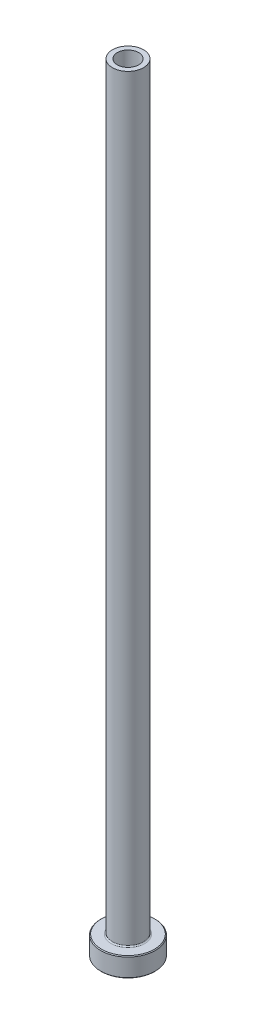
ISO-10303-21;
HEADER;
FILE_DESCRIPTION(('STEP AP214'),'2;1');
FILE_NAME('part.step','',(''),(''),'','','');
FILE_SCHEMA(('AUTOMOTIVE_DESIGN { 1 0 10303 214 1 1 1 1 }'));
ENDSEC;
DATA;
#1=APPLICATION_CONTEXT('core data for automotive mechanical design processes');
#2=APPLICATION_PROTOCOL_DEFINITION('international standard','automotive_design',2000,#1);
#3=PRODUCT_CONTEXT('',#1,'mechanical');
#4=PRODUCT('Part','Part','',(#3));
#5=PRODUCT_RELATED_PRODUCT_CATEGORY('part','',(#4));
#6=PRODUCT_DEFINITION_FORMATION('','',#4);
#7=PRODUCT_DEFINITION_CONTEXT('part definition',#1,'design');
#8=PRODUCT_DEFINITION('design','',#6,#7);
#9=PRODUCT_DEFINITION_SHAPE('','',#8);
#10=(LENGTH_UNIT() NAMED_UNIT(*) SI_UNIT(.MILLI.,.METRE.));
#11=(NAMED_UNIT(*) PLANE_ANGLE_UNIT() SI_UNIT($,.RADIAN.));
#12=(NAMED_UNIT(*) SI_UNIT($,.STERADIAN.) SOLID_ANGLE_UNIT());
#13=UNCERTAINTY_MEASURE_WITH_UNIT(LENGTH_MEASURE(1.E-05),#10,'distance_accuracy_value','');
#14=(GEOMETRIC_REPRESENTATION_CONTEXT(3) GLOBAL_UNCERTAINTY_ASSIGNED_CONTEXT((#13)) GLOBAL_UNIT_ASSIGNED_CONTEXT((#10,
#11,#12)) REPRESENTATION_CONTEXT('',''));
#15=CARTESIAN_POINT('',(0.,0.,0.));
#16=DIRECTION('',(0.,0.,1.));
#17=DIRECTION('',(1.,0.,0.));
#18=AXIS2_PLACEMENT_3D('',#15,#16,#17);
#19=CARTESIAN_POINT('',(0.,92.1876809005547,0.));
#20=DIRECTION('',(0.,1.,0.));
#21=DIRECTION('',(0.,0.,1.));
#22=AXIS2_PLACEMENT_3D('',#19,#20,#21);
#23=CYLINDRICAL_SURFACE('',#22,2.75);
#24=CARTESIAN_POINT('',(0.,200.,0.));
#25=DIRECTION('',(0.,1.,0.));
#26=DIRECTION('',(0.,0.,1.));
#27=AXIS2_PLACEMENT_3D('',#24,#25,#26);
#28=CIRCLE('',#27,2.75);
#29=CARTESIAN_POINT('',(0.,200.,2.75));
#30=VERTEX_POINT('',#29);
#31=EDGE_CURVE('E62',#30,#30,#28,.T.);
#32=ORIENTED_EDGE('',*,*,#31,.T.);
#33=EDGE_LOOP('',(#32));
#34=FACE_BOUND('',#33,.T.);
#35=CARTESIAN_POINT('',(0.,155.,0.));
#36=DIRECTION('',(0.,1.,0.));
#37=DIRECTION('',(0.,0.,1.));
#38=AXIS2_PLACEMENT_3D('',#35,#36,#37);
#39=CIRCLE('',#38,2.75);
#40=CARTESIAN_POINT('',(0.,155.,2.75));
#41=VERTEX_POINT('',#40);
#42=EDGE_CURVE('E71',#41,#41,#39,.T.);
#43=ORIENTED_EDGE('',*,*,#42,.F.);
#44=EDGE_LOOP('',(#43));
#45=FACE_BOUND('',#44,.T.);
#46=ADVANCED_FACE('F30',(#34,#45),#23,.F.);
#47=CARTESIAN_POINT('',(-2.75,200.,0.));
#48=DIRECTION('',(0.,1.,0.));
#49=DIRECTION('',(0.,0.,1.));
#50=AXIS2_PLACEMENT_3D('',#47,#48,#49);
#51=PLANE('',#50);
#52=CARTESIAN_POINT('',(0.,200.,0.));
#53=DIRECTION('',(0.,1.,0.));
#54=DIRECTION('',(0.,0.,1.));
#55=AXIS2_PLACEMENT_3D('',#52,#53,#54);
#56=CIRCLE('',#55,4.00000000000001);
#57=CARTESIAN_POINT('',(0.,200.,4.00000000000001));
#58=VERTEX_POINT('',#57);
#59=EDGE_CURVE('E65',#58,#58,#56,.T.);
#60=ORIENTED_EDGE('',*,*,#59,.T.);
#61=EDGE_LOOP('',(#60));
#62=FACE_BOUND('',#61,.T.);
#63=ORIENTED_EDGE('',*,*,#31,.F.);
#64=EDGE_LOOP('',(#63));
#65=FACE_BOUND('',#64,.T.);
#66=ADVANCED_FACE('F79',(#62,#65),#51,.T.);
#67=CARTESIAN_POINT('',(0.,92.1876809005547,0.));
#68=DIRECTION('',(0.,1.,0.));
#69=DIRECTION('',(0.,0.,1.));
#70=AXIS2_PLACEMENT_3D('',#67,#68,#69);
#71=CYLINDRICAL_SURFACE('',#70,4.);
#72=CARTESIAN_POINT('',(0.,5.3,0.));
#73=DIRECTION('',(0.,1.,0.));
#74=DIRECTION('',(0.,0.,1.));
#75=AXIS2_PLACEMENT_3D('',#72,#73,#74);
#76=CIRCLE('',#75,4.);
#77=CARTESIAN_POINT('',(0.,5.3,4.));
#78=VERTEX_POINT('',#77);
#79=EDGE_CURVE('E59',#78,#78,#76,.T.);
#80=ORIENTED_EDGE('',*,*,#79,.T.);
#81=EDGE_LOOP('',(#80));
#82=FACE_BOUND('',#81,.T.);
#83=ORIENTED_EDGE('',*,*,#59,.F.);
#84=EDGE_LOOP('',(#83));
#85=FACE_BOUND('',#84,.T.);
#86=ADVANCED_FACE('F85',(#82,#85),#71,.T.);
#87=CARTESIAN_POINT('',(-3.99999999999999,5.,0.));
#88=DIRECTION('',(0.,1.,0.));
#89=DIRECTION('',(0.,0.,1.));
#90=AXIS2_PLACEMENT_3D('',#87,#88,#89);
#91=PLANE('',#90);
#92=CARTESIAN_POINT('',(0.,5.,0.));
#93=DIRECTION('',(0.,1.,0.));
#94=DIRECTION('',(0.,0.,1.));
#95=AXIS2_PLACEMENT_3D('',#92,#93,#94);
#96=CIRCLE('',#95,6.8);
#97=CARTESIAN_POINT('',(0.,5.,6.8));
#98=VERTEX_POINT('',#97);
#99=EDGE_CURVE('E53',#98,#98,#96,.T.);
#100=ORIENTED_EDGE('',*,*,#99,.T.);
#101=EDGE_LOOP('',(#100));
#102=FACE_BOUND('',#101,.T.);
#103=CARTESIAN_POINT('',(0.,5.,0.));
#104=DIRECTION('',(0.,1.,0.));
#105=DIRECTION('',(0.,0.,1.));
#106=AXIS2_PLACEMENT_3D('',#103,#104,#105);
#107=CIRCLE('',#106,4.3);
#108=CARTESIAN_POINT('',(0.,5.,4.3));
#109=VERTEX_POINT('',#108);
#110=EDGE_CURVE('E56',#109,#109,#107,.F.);
#111=ORIENTED_EDGE('',*,*,#110,.T.);
#112=EDGE_LOOP('',(#111));
#113=FACE_BOUND('',#112,.T.);
#114=ADVANCED_FACE('F111',(#102,#113),#91,.T.);
#115=CARTESIAN_POINT('',(0.,92.1876809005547,0.));
#116=DIRECTION('',(0.,1.,0.));
#117=DIRECTION('',(0.,0.,1.));
#118=AXIS2_PLACEMENT_3D('',#115,#116,#117);
#119=CYLINDRICAL_SURFACE('',#118,6.99999999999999);
#120=CARTESIAN_POINT('',(0.,4.8,0.));
#121=DIRECTION('',(0.,1.,0.));
#122=DIRECTION('',(0.,0.,1.));
#123=AXIS2_PLACEMENT_3D('',#120,#121,#122);
#124=CIRCLE('',#123,6.99999999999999);
#125=CARTESIAN_POINT('',(0.,4.8,6.99999999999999));
#126=VERTEX_POINT('',#125);
#127=EDGE_CURVE('E45',#126,#126,#124,.F.);
#128=ORIENTED_EDGE('',*,*,#127,.T.);
#129=EDGE_LOOP('',(#128));
#130=FACE_BOUND('',#129,.T.);
#131=CARTESIAN_POINT('',(0.,0.20000000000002,0.));
#132=DIRECTION('',(0.,-1.,0.));
#133=DIRECTION('',(0.,0.,-1.));
#134=AXIS2_PLACEMENT_3D('',#131,#132,#133);
#135=CIRCLE('',#134,6.99999999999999);
#136=CARTESIAN_POINT('',(0.,0.20000000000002,-6.99999999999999));
#137=VERTEX_POINT('',#136);
#138=EDGE_CURVE('E50',#137,#137,#135,.F.);
#139=ORIENTED_EDGE('',*,*,#138,.T.);
#140=EDGE_LOOP('',(#139));
#141=FACE_BOUND('',#140,.T.);
#142=ADVANCED_FACE('F108',(#130,#141),#119,.T.);
#143=CARTESIAN_POINT('',(-6.99999999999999,0.,0.));
#144=DIRECTION('',(0.,-1.,0.));
#145=DIRECTION('',(0.,0.,-1.));
#146=AXIS2_PLACEMENT_3D('',#143,#144,#145);
#147=PLANE('',#146);
#148=CARTESIAN_POINT('',(0.,0.,0.));
#149=DIRECTION('',(0.,-1.,0.));
#150=DIRECTION('',(0.,0.,-1.));
#151=AXIS2_PLACEMENT_3D('',#148,#149,#150);
#152=CIRCLE('',#151,3.49999999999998);
#153=CARTESIAN_POINT('',(0.,0.,-3.49999999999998));
#154=VERTEX_POINT('',#153);
#155=EDGE_CURVE('E37',#154,#154,#152,.F.);
#156=ORIENTED_EDGE('',*,*,#155,.T.);
#157=EDGE_LOOP('',(#156));
#158=FACE_BOUND('',#157,.T.);
#159=CARTESIAN_POINT('',(0.,0.,0.));
#160=DIRECTION('',(0.,-1.,0.));
#161=DIRECTION('',(0.,0.,-1.));
#162=AXIS2_PLACEMENT_3D('',#159,#160,#161);
#163=CIRCLE('',#162,6.79999999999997);
#164=CARTESIAN_POINT('',(0.,0.,-6.79999999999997));
#165=VERTEX_POINT('',#164);
#166=EDGE_CURVE('E41',#165,#165,#163,.T.);
#167=ORIENTED_EDGE('',*,*,#166,.T.);
#168=EDGE_LOOP('',(#167));
#169=FACE_BOUND('',#168,.T.);
#170=ADVANCED_FACE('F110',(#158,#169),#147,.T.);
#171=CARTESIAN_POINT('',(0.,92.1876809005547,0.));
#172=DIRECTION('',(0.,1.,0.));
#173=DIRECTION('',(0.,0.,1.));
#174=AXIS2_PLACEMENT_3D('',#171,#172,#173);
#175=CYLINDRICAL_SURFACE('',#174,3.);
#176=CARTESIAN_POINT('',(0.,0.5,0.));
#177=DIRECTION('',(0.,-1.,0.));
#178=DIRECTION('',(0.,0.,-1.));
#179=AXIS2_PLACEMENT_3D('',#176,#177,#178);
#180=CIRCLE('',#179,3.);
#181=CARTESIAN_POINT('',(0.,0.5,-3.));
#182=VERTEX_POINT('',#181);
#183=EDGE_CURVE('E10',#182,#182,#180,.T.);
#184=ORIENTED_EDGE('',*,*,#183,.T.);
#185=EDGE_LOOP('',(#184));
#186=FACE_BOUND('',#185,.T.);
#187=CARTESIAN_POINT('',(0.,143.,0.));
#188=DIRECTION('',(0.,1.,0.));
#189=DIRECTION('',(0.,0.,1.));
#190=AXIS2_PLACEMENT_3D('',#187,#188,#189);
#191=CIRCLE('',#190,3.00000000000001);
#192=CARTESIAN_POINT('',(0.,143.,3.00000000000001));
#193=VERTEX_POINT('',#192);
#194=EDGE_CURVE('E68',#193,#193,#191,.T.);
#195=ORIENTED_EDGE('',*,*,#194,.T.);
#196=EDGE_LOOP('',(#195));
#197=FACE_BOUND('',#196,.T.);
#198=ADVANCED_FACE('F118',(#186,#197),#175,.F.);
#199=CARTESIAN_POINT('',(0.,143.,0.));
#200=DIRECTION('',(0.,-1.,0.));
#201=DIRECTION('',(0.,0.,-1.));
#202=AXIS2_PLACEMENT_3D('',#199,#200,#201);
#203=CONICAL_SURFACE('',#202,3.00000000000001,0.0208303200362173);
#204=ORIENTED_EDGE('',*,*,#42,.T.);
#205=EDGE_LOOP('',(#204));
#206=FACE_BOUND('',#205,.T.);
#207=ORIENTED_EDGE('',*,*,#194,.F.);
#208=EDGE_LOOP('',(#207));
#209=FACE_BOUND('',#208,.T.);
#210=ADVANCED_FACE('F75',(#206,#209),#203,.F.);
#211=CARTESIAN_POINT('',(0.,5.3,0.));
#212=DIRECTION('',(0.,1.,0.));
#213=DIRECTION('',(0.,0.,1.));
#214=AXIS2_PLACEMENT_3D('',#211,#212,#213);
#215=TOROIDAL_SURFACE('',#214,4.3,0.3);
#216=ORIENTED_EDGE('',*,*,#110,.F.);
#217=EDGE_LOOP('',(#216));
#218=FACE_BOUND('',#217,.T.);
#219=ORIENTED_EDGE('',*,*,#79,.F.);
#220=EDGE_LOOP('',(#219));
#221=FACE_BOUND('',#220,.T.);
#222=ADVANCED_FACE('F90',(#218,#221),#215,.F.);
#223=CARTESIAN_POINT('',(0.,5.,0.));
#224=DIRECTION('',(0.,-1.,0.));
#225=DIRECTION('',(0.,0.,-1.));
#226=AXIS2_PLACEMENT_3D('',#223,#224,#225);
#227=CONICAL_SURFACE('',#226,6.8,0.785398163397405);
#228=ORIENTED_EDGE('',*,*,#127,.F.);
#229=EDGE_LOOP('',(#228));
#230=FACE_BOUND('',#229,.T.);
#231=ORIENTED_EDGE('',*,*,#99,.F.);
#232=EDGE_LOOP('',(#231));
#233=FACE_BOUND('',#232,.T.);
#234=ADVANCED_FACE('F93',(#230,#233),#227,.T.);
#235=CARTESIAN_POINT('',(0.,0.20000000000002,0.));
#236=DIRECTION('',(0.,1.,0.));
#237=DIRECTION('',(0.,0.,1.));
#238=AXIS2_PLACEMENT_3D('',#235,#236,#237);
#239=CONICAL_SURFACE('',#238,6.99999999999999,0.78539816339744);
#240=ORIENTED_EDGE('',*,*,#166,.F.);
#241=EDGE_LOOP('',(#240));
#242=FACE_BOUND('',#241,.T.);
#243=ORIENTED_EDGE('',*,*,#138,.F.);
#244=EDGE_LOOP('',(#243));
#245=FACE_BOUND('',#244,.T.);
#246=ADVANCED_FACE('F96',(#242,#245),#239,.T.);
#247=CARTESIAN_POINT('',(0.,0.,0.));
#248=DIRECTION('',(0.,-1.,0.));
#249=DIRECTION('',(0.,0.,-1.));
#250=AXIS2_PLACEMENT_3D('',#247,#248,#249);
#251=CONICAL_SURFACE('',#250,3.49999999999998,0.785398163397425);
#252=ORIENTED_EDGE('',*,*,#183,.F.);
#253=EDGE_LOOP('',(#252));
#254=FACE_BOUND('',#253,.T.);
#255=ORIENTED_EDGE('',*,*,#155,.F.);
#256=EDGE_LOOP('',(#255));
#257=FACE_BOUND('',#256,.T.);
#258=ADVANCED_FACE('F32',(#254,#257),#251,.F.);
#259=CLOSED_SHELL('',(#46,#66,#86,#114,#142,#170,#198,#210,#222,#234,#246,#258));
#260=MANIFOLD_SOLID_BREP('B2',#259);
#261=ADVANCED_BREP_SHAPE_REPRESENTATION('',(#18,#260),#14);
#262=SHAPE_DEFINITION_REPRESENTATION(#9,#261);
ENDSEC;
END-ISO-10303-21;
